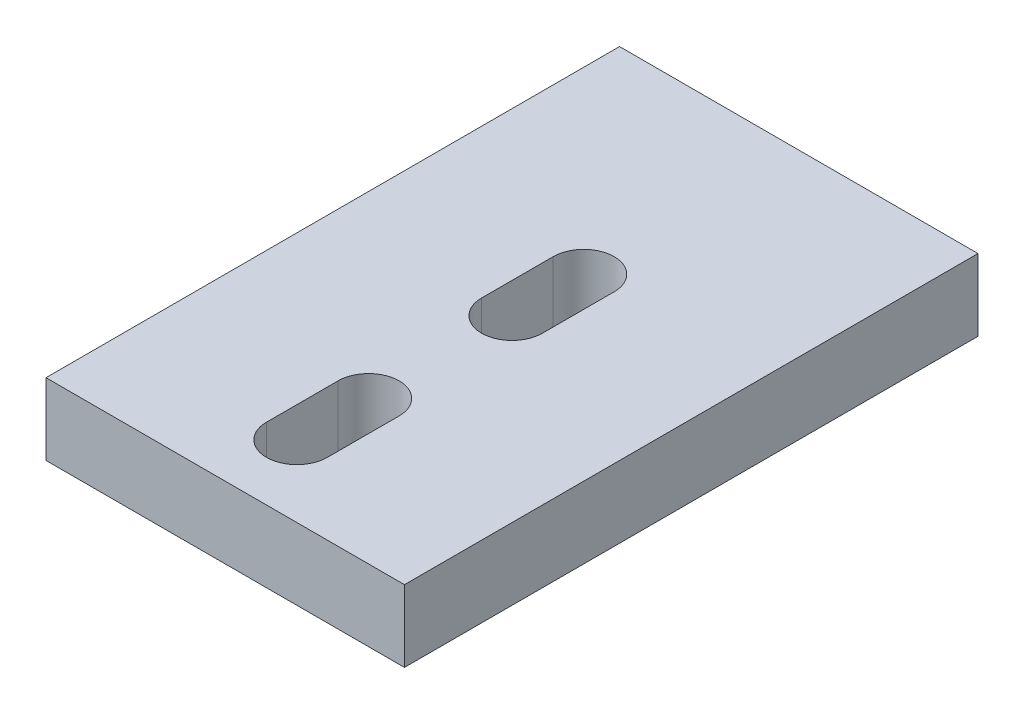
ISO-10303-21;
HEADER;
FILE_DESCRIPTION(('STEP AP214'),'2;1');
FILE_NAME('part.step','',(''),(''),'','','');
FILE_SCHEMA(('AUTOMOTIVE_DESIGN { 1 0 10303 214 1 1 1 1 }'));
ENDSEC;
DATA;
#1=APPLICATION_CONTEXT('core data for automotive mechanical design processes');
#2=APPLICATION_PROTOCOL_DEFINITION('international standard','automotive_design',2000,#1);
#3=PRODUCT_CONTEXT('',#1,'mechanical');
#4=PRODUCT('Part','Part','',(#3));
#5=PRODUCT_RELATED_PRODUCT_CATEGORY('part','',(#4));
#6=PRODUCT_DEFINITION_FORMATION('','',#4);
#7=PRODUCT_DEFINITION_CONTEXT('part definition',#1,'design');
#8=PRODUCT_DEFINITION('design','',#6,#7);
#9=PRODUCT_DEFINITION_SHAPE('','',#8);
#10=(LENGTH_UNIT() NAMED_UNIT(*) SI_UNIT(.MILLI.,.METRE.));
#11=(NAMED_UNIT(*) PLANE_ANGLE_UNIT() SI_UNIT($,.RADIAN.));
#12=(NAMED_UNIT(*) SI_UNIT($,.STERADIAN.) SOLID_ANGLE_UNIT());
#13=UNCERTAINTY_MEASURE_WITH_UNIT(LENGTH_MEASURE(1.E-05),#10,'distance_accuracy_value','');
#14=(GEOMETRIC_REPRESENTATION_CONTEXT(3) GLOBAL_UNCERTAINTY_ASSIGNED_CONTEXT((#13)) GLOBAL_UNIT_ASSIGNED_CONTEXT((#10,
#11,#12)) REPRESENTATION_CONTEXT('',''));
#15=CARTESIAN_POINT('',(0.,0.,0.));
#16=DIRECTION('',(0.,0.,1.));
#17=DIRECTION('',(1.,0.,0.));
#18=AXIS2_PLACEMENT_3D('',#15,#16,#17);
#19=CARTESIAN_POINT('',(-50.,-10.,40.));
#20=DIRECTION('',(1.,0.,0.));
#21=DIRECTION('',(0.,0.,-1.));
#22=AXIS2_PLACEMENT_3D('',#19,#20,#21);
#23=PLANE('',#22);
#24=DIRECTION('',(0.,-1.,0.));
#25=VECTOR('',#24,1.);
#26=CARTESIAN_POINT('',(-50.,-10.,-40.));
#27=LINE('',#26,#25);
#28=CARTESIAN_POINT('',(-50.,0.,-40.));
#29=VERTEX_POINT('',#28);
#30=CARTESIAN_POINT('',(-50.,-10.,-40.));
#31=VERTEX_POINT('',#30);
#32=EDGE_CURVE('E219',#29,#31,#27,.T.);
#33=ORIENTED_EDGE('',*,*,#32,.T.);
#34=DIRECTION('',(0.,0.,-1.));
#35=VECTOR('',#34,1.);
#36=CARTESIAN_POINT('',(-50.,-10.,40.));
#37=LINE('',#36,#35);
#38=CARTESIAN_POINT('',(-50.,-10.,40.));
#39=VERTEX_POINT('',#38);
#40=EDGE_CURVE('E11',#39,#31,#37,.T.);
#41=ORIENTED_EDGE('',*,*,#40,.F.);
#42=DIRECTION('',(0.,-1.,0.));
#43=VECTOR('',#42,1.);
#44=CARTESIAN_POINT('',(-50.,-10.,40.));
#45=LINE('',#44,#43);
#46=CARTESIAN_POINT('',(-50.,0.,40.));
#47=VERTEX_POINT('',#46);
#48=EDGE_CURVE('E232',#47,#39,#45,.T.);
#49=ORIENTED_EDGE('',*,*,#48,.F.);
#50=DIRECTION('',(0.,0.,-1.));
#51=VECTOR('',#50,1.);
#52=CARTESIAN_POINT('',(-50.,0.,40.));
#53=LINE('',#52,#51);
#54=EDGE_CURVE('E245',#47,#29,#53,.T.);
#55=ORIENTED_EDGE('',*,*,#54,.T.);
#56=EDGE_LOOP('',(#33,#41,#49,#55));
#57=FACE_BOUND('',#56,.T.);
#58=ADVANCED_FACE('F40',(#57),#23,.F.);
#59=CARTESIAN_POINT('',(0.,-10.,40.));
#60=DIRECTION('',(0.,1.,0.));
#61=DIRECTION('',(-1.,0.,0.));
#62=AXIS2_PLACEMENT_3D('',#59,#60,#61);
#63=PLANE('',#62);
#64=DIRECTION('',(0.,0.,-1.));
#65=VECTOR('',#64,1.);
#66=CARTESIAN_POINT('',(-29.25,-10.,0.));
#67=LINE('',#66,#65);
#68=CARTESIAN_POINT('',(-29.25,-10.,0.));
#69=VERTEX_POINT('',#68);
#70=CARTESIAN_POINT('',(-29.25,-10.,-10.));
#71=VERTEX_POINT('',#70);
#72=EDGE_CURVE('E151',#69,#71,#67,.T.);
#73=ORIENTED_EDGE('',*,*,#72,.F.);
#74=CARTESIAN_POINT('',(-25.,-10.,0.));
#75=DIRECTION('',(0.,1.,0.));
#76=DIRECTION('',(-1.,0.,0.));
#77=AXIS2_PLACEMENT_3D('',#74,#75,#76);
#78=CIRCLE('',#77,4.25);
#79=CARTESIAN_POINT('',(-20.75,-10.,0.));
#80=VERTEX_POINT('',#79);
#81=EDGE_CURVE('E131',#80,#69,#78,.F.);
#82=ORIENTED_EDGE('',*,*,#81,.F.);
#83=DIRECTION('',(0.,0.,1.));
#84=VECTOR('',#83,1.);
#85=CARTESIAN_POINT('',(-20.75,-10.,0.));
#86=LINE('',#85,#84);
#87=CARTESIAN_POINT('',(-20.75,-10.,-10.));
#88=VERTEX_POINT('',#87);
#89=EDGE_CURVE('E141',#88,#80,#86,.T.);
#90=ORIENTED_EDGE('',*,*,#89,.F.);
#91=CARTESIAN_POINT('',(-25.,-10.,-10.));
#92=DIRECTION('',(0.,1.,0.));
#93=DIRECTION('',(-1.,0.,0.));
#94=AXIS2_PLACEMENT_3D('',#91,#92,#93);
#95=CIRCLE('',#94,4.25);
#96=EDGE_CURVE('E55',#71,#88,#95,.F.);
#97=ORIENTED_EDGE('',*,*,#96,.F.);
#98=EDGE_LOOP('',(#73,#82,#90,#97));
#99=FACE_BOUND('',#98,.T.);
#100=DIRECTION('',(0.,0.,-1.));
#101=VECTOR('',#100,1.);
#102=CARTESIAN_POINT('',(-29.25,-10.,30.));
#103=LINE('',#102,#101);
#104=CARTESIAN_POINT('',(-29.25,-10.,30.));
#105=VERTEX_POINT('',#104);
#106=CARTESIAN_POINT('',(-29.25,-10.,20.));
#107=VERTEX_POINT('',#106);
#108=EDGE_CURVE('E181',#105,#107,#103,.T.);
#109=ORIENTED_EDGE('',*,*,#108,.F.);
#110=CARTESIAN_POINT('',(-25.,-10.,30.));
#111=DIRECTION('',(0.,1.,0.));
#112=DIRECTION('',(-1.,0.,0.));
#113=AXIS2_PLACEMENT_3D('',#110,#111,#112);
#114=CIRCLE('',#113,4.25);
#115=CARTESIAN_POINT('',(-20.75,-10.,30.));
#116=VERTEX_POINT('',#115);
#117=EDGE_CURVE('E185',#116,#105,#114,.F.);
#118=ORIENTED_EDGE('',*,*,#117,.F.);
#119=DIRECTION('',(0.,0.,1.));
#120=VECTOR('',#119,1.);
#121=CARTESIAN_POINT('',(-20.75,-10.,30.));
#122=LINE('',#121,#120);
#123=CARTESIAN_POINT('',(-20.75,-10.,20.));
#124=VERTEX_POINT('',#123);
#125=EDGE_CURVE('E207',#124,#116,#122,.T.);
#126=ORIENTED_EDGE('',*,*,#125,.F.);
#127=CARTESIAN_POINT('',(-25.,-10.,20.));
#128=DIRECTION('',(0.,1.,0.));
#129=DIRECTION('',(-1.,0.,0.));
#130=AXIS2_PLACEMENT_3D('',#127,#128,#129);
#131=CIRCLE('',#130,4.25);
#132=EDGE_CURVE('E145',#107,#124,#131,.F.);
#133=ORIENTED_EDGE('',*,*,#132,.F.);
#134=EDGE_LOOP('',(#109,#118,#126,#133));
#135=FACE_BOUND('',#134,.T.);
#136=DIRECTION('',(1.,0.,0.));
#137=VECTOR('',#136,1.);
#138=CARTESIAN_POINT('',(0.,-10.,-40.));
#139=LINE('',#138,#137);
#140=CARTESIAN_POINT('',(0.,-10.,-40.));
#141=VERTEX_POINT('',#140);
#142=EDGE_CURVE('E223',#31,#141,#139,.T.);
#143=ORIENTED_EDGE('',*,*,#142,.T.);
#144=DIRECTION('',(0.,0.,-1.));
#145=VECTOR('',#144,1.);
#146=CARTESIAN_POINT('',(0.,-10.,40.));
#147=LINE('',#146,#145);
#148=CARTESIAN_POINT('',(0.,-10.,40.));
#149=VERTEX_POINT('',#148);
#150=EDGE_CURVE('E48',#149,#141,#147,.T.);
#151=ORIENTED_EDGE('',*,*,#150,.F.);
#152=DIRECTION('',(1.,0.,0.));
#153=VECTOR('',#152,1.);
#154=CARTESIAN_POINT('',(0.,-10.,40.));
#155=LINE('',#154,#153);
#156=EDGE_CURVE('E236',#39,#149,#155,.T.);
#157=ORIENTED_EDGE('',*,*,#156,.F.);
#158=ORIENTED_EDGE('',*,*,#40,.T.);
#159=EDGE_LOOP('',(#143,#151,#157,#158));
#160=FACE_BOUND('',#159,.T.);
#161=ADVANCED_FACE('F148',(#99,#135,#160),#63,.F.);
#162=CARTESIAN_POINT('',(0.,0.,40.));
#163=DIRECTION('',(-1.,0.,0.));
#164=DIRECTION('',(0.,-1.,0.));
#165=AXIS2_PLACEMENT_3D('',#162,#163,#164);
#166=PLANE('',#165);
#167=DIRECTION('',(0.,1.,0.));
#168=VECTOR('',#167,1.);
#169=CARTESIAN_POINT('',(0.,0.,-40.));
#170=LINE('',#169,#168);
#171=CARTESIAN_POINT('',(0.,0.,-40.));
#172=VERTEX_POINT('',#171);
#173=EDGE_CURVE('E226',#141,#172,#170,.T.);
#174=ORIENTED_EDGE('',*,*,#173,.T.);
#175=DIRECTION('',(0.,0.,-1.));
#176=VECTOR('',#175,1.);
#177=CARTESIAN_POINT('',(0.,0.,40.));
#178=LINE('',#177,#176);
#179=CARTESIAN_POINT('',(0.,0.,40.));
#180=VERTEX_POINT('',#179);
#181=EDGE_CURVE('E249',#180,#172,#178,.T.);
#182=ORIENTED_EDGE('',*,*,#181,.F.);
#183=DIRECTION('',(0.,1.,0.));
#184=VECTOR('',#183,1.);
#185=CARTESIAN_POINT('',(0.,0.,40.));
#186=LINE('',#185,#184);
#187=EDGE_CURVE('E239',#149,#180,#186,.T.);
#188=ORIENTED_EDGE('',*,*,#187,.F.);
#189=ORIENTED_EDGE('',*,*,#150,.T.);
#190=EDGE_LOOP('',(#174,#182,#188,#189));
#191=FACE_BOUND('',#190,.T.);
#192=ADVANCED_FACE('F258',(#191),#166,.F.);
#193=CARTESIAN_POINT('',(-50.,0.,40.));
#194=DIRECTION('',(0.,-1.,0.));
#195=DIRECTION('',(0.,0.,-1.));
#196=AXIS2_PLACEMENT_3D('',#193,#194,#195);
#197=PLANE('',#196);
#198=DIRECTION('',(0.,0.,-1.));
#199=VECTOR('',#198,1.);
#200=CARTESIAN_POINT('',(-20.75,0.,0.));
#201=LINE('',#200,#199);
#202=CARTESIAN_POINT('',(-20.75,0.,0.));
#203=VERTEX_POINT('',#202);
#204=CARTESIAN_POINT('',(-20.75,0.,-10.));
#205=VERTEX_POINT('',#204);
#206=EDGE_CURVE('E157',#203,#205,#201,.T.);
#207=ORIENTED_EDGE('',*,*,#206,.F.);
#208=CARTESIAN_POINT('',(-25.,0.,0.));
#209=DIRECTION('',(0.,1.,0.));
#210=DIRECTION('',(0.,0.,-1.));
#211=AXIS2_PLACEMENT_3D('',#208,#209,#210);
#212=CIRCLE('',#211,4.25);
#213=CARTESIAN_POINT('',(-29.25,0.,0.));
#214=VERTEX_POINT('',#213);
#215=EDGE_CURVE('E63',#214,#203,#212,.T.);
#216=ORIENTED_EDGE('',*,*,#215,.F.);
#217=DIRECTION('',(0.,0.,1.));
#218=VECTOR('',#217,1.);
#219=CARTESIAN_POINT('',(-29.25,0.,0.));
#220=LINE('',#219,#218);
#221=CARTESIAN_POINT('',(-29.25,0.,-10.));
#222=VERTEX_POINT('',#221);
#223=EDGE_CURVE('E138',#222,#214,#220,.T.);
#224=ORIENTED_EDGE('',*,*,#223,.F.);
#225=CARTESIAN_POINT('',(-25.,0.,-10.));
#226=DIRECTION('',(0.,1.,0.));
#227=DIRECTION('',(0.,0.,1.));
#228=AXIS2_PLACEMENT_3D('',#225,#226,#227);
#229=CIRCLE('',#228,4.25);
#230=EDGE_CURVE('E165',#205,#222,#229,.T.);
#231=ORIENTED_EDGE('',*,*,#230,.F.);
#232=EDGE_LOOP('',(#207,#216,#224,#231));
#233=FACE_BOUND('',#232,.T.);
#234=DIRECTION('',(0.,0.,-1.));
#235=VECTOR('',#234,1.);
#236=CARTESIAN_POINT('',(-20.75,0.,30.));
#237=LINE('',#236,#235);
#238=CARTESIAN_POINT('',(-20.75,0.,30.));
#239=VERTEX_POINT('',#238);
#240=CARTESIAN_POINT('',(-20.75,0.,20.));
#241=VERTEX_POINT('',#240);
#242=EDGE_CURVE('E192',#239,#241,#237,.T.);
#243=ORIENTED_EDGE('',*,*,#242,.F.);
#244=CARTESIAN_POINT('',(-25.,0.,30.));
#245=DIRECTION('',(0.,1.,0.));
#246=DIRECTION('',(0.,0.,-1.));
#247=AXIS2_PLACEMENT_3D('',#244,#245,#246);
#248=CIRCLE('',#247,4.25);
#249=CARTESIAN_POINT('',(-29.25,0.,30.));
#250=VERTEX_POINT('',#249);
#251=EDGE_CURVE('E189',#250,#239,#248,.T.);
#252=ORIENTED_EDGE('',*,*,#251,.F.);
#253=DIRECTION('',(0.,0.,1.));
#254=VECTOR('',#253,1.);
#255=CARTESIAN_POINT('',(-29.25,0.,30.));
#256=LINE('',#255,#254);
#257=CARTESIAN_POINT('',(-29.25,0.,20.));
#258=VERTEX_POINT('',#257);
#259=EDGE_CURVE('E200',#258,#250,#256,.T.);
#260=ORIENTED_EDGE('',*,*,#259,.F.);
#261=CARTESIAN_POINT('',(-25.,0.,20.));
#262=DIRECTION('',(0.,1.,0.));
#263=DIRECTION('',(0.,0.,1.));
#264=AXIS2_PLACEMENT_3D('',#261,#262,#263);
#265=CIRCLE('',#264,4.25);
#266=EDGE_CURVE('E196',#241,#258,#265,.T.);
#267=ORIENTED_EDGE('',*,*,#266,.F.);
#268=EDGE_LOOP('',(#243,#252,#260,#267));
#269=FACE_BOUND('',#268,.T.);
#270=DIRECTION('',(-1.,0.,0.));
#271=VECTOR('',#270,1.);
#272=CARTESIAN_POINT('',(-50.,0.,-40.));
#273=LINE('',#272,#271);
#274=EDGE_CURVE('E229',#172,#29,#273,.T.);
#275=ORIENTED_EDGE('',*,*,#274,.T.);
#276=ORIENTED_EDGE('',*,*,#54,.F.);
#277=DIRECTION('',(-1.,0.,0.));
#278=VECTOR('',#277,1.);
#279=CARTESIAN_POINT('',(-50.,0.,40.));
#280=LINE('',#279,#278);
#281=EDGE_CURVE('E242',#180,#47,#280,.T.);
#282=ORIENTED_EDGE('',*,*,#281,.F.);
#283=ORIENTED_EDGE('',*,*,#181,.T.);
#284=EDGE_LOOP('',(#275,#276,#282,#283));
#285=FACE_BOUND('',#284,.T.);
#286=ADVANCED_FACE('F267',(#233,#269,#285),#197,.F.);
#287=CARTESIAN_POINT('',(-50.,0.,40.));
#288=DIRECTION('',(0.,0.,-1.));
#289=DIRECTION('',(-1.,0.,0.));
#290=AXIS2_PLACEMENT_3D('',#287,#288,#289);
#291=PLANE('',#290);
#292=ORIENTED_EDGE('',*,*,#48,.T.);
#293=ORIENTED_EDGE('',*,*,#156,.T.);
#294=ORIENTED_EDGE('',*,*,#187,.T.);
#295=ORIENTED_EDGE('',*,*,#281,.T.);
#296=EDGE_LOOP('',(#292,#293,#294,#295));
#297=FACE_BOUND('',#296,.T.);
#298=ADVANCED_FACE('F273',(#297),#291,.F.);
#299=CARTESIAN_POINT('',(-50.,0.,-40.));
#300=DIRECTION('',(0.,0.,-1.));
#301=DIRECTION('',(-1.,0.,0.));
#302=AXIS2_PLACEMENT_3D('',#299,#300,#301);
#303=PLANE('',#302);
#304=ORIENTED_EDGE('',*,*,#32,.F.);
#305=ORIENTED_EDGE('',*,*,#274,.F.);
#306=ORIENTED_EDGE('',*,*,#173,.F.);
#307=ORIENTED_EDGE('',*,*,#142,.F.);
#308=EDGE_LOOP('',(#304,#305,#306,#307));
#309=FACE_BOUND('',#308,.T.);
#310=ADVANCED_FACE('F264',(#309),#303,.T.);
#311=CARTESIAN_POINT('',(-25.,-10.001,30.));
#312=DIRECTION('',(0.,1.,0.));
#313=DIRECTION('',(0.,0.,1.));
#314=AXIS2_PLACEMENT_3D('',#311,#312,#313);
#315=CYLINDRICAL_SURFACE('',#314,4.25);
#316=ORIENTED_EDGE('',*,*,#117,.T.);
#317=DIRECTION('',(0.,1.,0.));
#318=VECTOR('',#317,1.);
#319=CARTESIAN_POINT('',(-29.25,-10.001,30.));
#320=LINE('',#319,#318);
#321=EDGE_CURVE('E204',#105,#250,#320,.T.);
#322=ORIENTED_EDGE('',*,*,#321,.T.);
#323=ORIENTED_EDGE('',*,*,#251,.T.);
#324=DIRECTION('',(0.,1.,0.));
#325=VECTOR('',#324,1.);
#326=CARTESIAN_POINT('',(-20.75,-10.001,30.));
#327=LINE('',#326,#325);
#328=EDGE_CURVE('E203',#116,#239,#327,.T.);
#329=ORIENTED_EDGE('',*,*,#328,.F.);
#330=EDGE_LOOP('',(#316,#322,#323,#329));
#331=FACE_BOUND('',#330,.T.);
#332=ADVANCED_FACE('F288',(#331),#315,.F.);
#333=CARTESIAN_POINT('',(-29.25,-10.001,30.));
#334=DIRECTION('',(-1.,0.,0.));
#335=DIRECTION('',(0.,0.,1.));
#336=AXIS2_PLACEMENT_3D('',#333,#334,#335);
#337=PLANE('',#336);
#338=ORIENTED_EDGE('',*,*,#108,.T.);
#339=DIRECTION('',(0.,1.,0.));
#340=VECTOR('',#339,1.);
#341=CARTESIAN_POINT('',(-29.25,-10.001,20.));
#342=LINE('',#341,#340);
#343=EDGE_CURVE('E208',#107,#258,#342,.T.);
#344=ORIENTED_EDGE('',*,*,#343,.T.);
#345=ORIENTED_EDGE('',*,*,#259,.T.);
#346=ORIENTED_EDGE('',*,*,#321,.F.);
#347=EDGE_LOOP('',(#338,#344,#345,#346));
#348=FACE_BOUND('',#347,.T.);
#349=ADVANCED_FACE('F291',(#348),#337,.F.);
#350=CARTESIAN_POINT('',(-25.,-10.001,20.));
#351=DIRECTION('',(0.,1.,0.));
#352=DIRECTION('',(0.,0.,1.));
#353=AXIS2_PLACEMENT_3D('',#350,#351,#352);
#354=CYLINDRICAL_SURFACE('',#353,4.25);
#355=ORIENTED_EDGE('',*,*,#132,.T.);
#356=DIRECTION('',(0.,1.,0.));
#357=VECTOR('',#356,1.);
#358=CARTESIAN_POINT('',(-20.75,-10.001,20.));
#359=LINE('',#358,#357);
#360=EDGE_CURVE('E211',#124,#241,#359,.T.);
#361=ORIENTED_EDGE('',*,*,#360,.T.);
#362=ORIENTED_EDGE('',*,*,#266,.T.);
#363=ORIENTED_EDGE('',*,*,#343,.F.);
#364=EDGE_LOOP('',(#355,#361,#362,#363));
#365=FACE_BOUND('',#364,.T.);
#366=ADVANCED_FACE('F296',(#365),#354,.F.);
#367=CARTESIAN_POINT('',(-20.75,-10.001,30.));
#368=DIRECTION('',(1.,0.,0.));
#369=DIRECTION('',(0.,0.,-1.));
#370=AXIS2_PLACEMENT_3D('',#367,#368,#369);
#371=PLANE('',#370);
#372=ORIENTED_EDGE('',*,*,#125,.T.);
#373=ORIENTED_EDGE('',*,*,#328,.T.);
#374=ORIENTED_EDGE('',*,*,#242,.T.);
#375=ORIENTED_EDGE('',*,*,#360,.F.);
#376=EDGE_LOOP('',(#372,#373,#374,#375));
#377=FACE_BOUND('',#376,.T.);
#378=ADVANCED_FACE('F293',(#377),#371,.F.);
#379=CARTESIAN_POINT('',(-25.,-10.001,0.));
#380=DIRECTION('',(0.,1.,0.));
#381=DIRECTION('',(0.,0.,1.));
#382=AXIS2_PLACEMENT_3D('',#379,#380,#381);
#383=CYLINDRICAL_SURFACE('',#382,4.25);
#384=ORIENTED_EDGE('',*,*,#81,.T.);
#385=DIRECTION('',(0.,1.,0.));
#386=VECTOR('',#385,1.);
#387=CARTESIAN_POINT('',(-29.25,-10.001,0.));
#388=LINE('',#387,#386);
#389=EDGE_CURVE('E146',#69,#214,#388,.T.);
#390=ORIENTED_EDGE('',*,*,#389,.T.);
#391=ORIENTED_EDGE('',*,*,#215,.T.);
#392=DIRECTION('',(0.,1.,0.));
#393=VECTOR('',#392,1.);
#394=CARTESIAN_POINT('',(-20.75,-10.001,0.));
#395=LINE('',#394,#393);
#396=EDGE_CURVE('E127',#80,#203,#395,.T.);
#397=ORIENTED_EDGE('',*,*,#396,.F.);
#398=EDGE_LOOP('',(#384,#390,#391,#397));
#399=FACE_BOUND('',#398,.T.);
#400=ADVANCED_FACE('F129',(#399),#383,.F.);
#401=CARTESIAN_POINT('',(-29.25,-10.001,0.));
#402=DIRECTION('',(-1.,0.,0.));
#403=DIRECTION('',(0.,0.,1.));
#404=AXIS2_PLACEMENT_3D('',#401,#402,#403);
#405=PLANE('',#404);
#406=ORIENTED_EDGE('',*,*,#72,.T.);
#407=DIRECTION('',(0.,1.,0.));
#408=VECTOR('',#407,1.);
#409=CARTESIAN_POINT('',(-29.25,-10.001,-10.));
#410=LINE('',#409,#408);
#411=EDGE_CURVE('E174',#71,#222,#410,.T.);
#412=ORIENTED_EDGE('',*,*,#411,.T.);
#413=ORIENTED_EDGE('',*,*,#223,.T.);
#414=ORIENTED_EDGE('',*,*,#389,.F.);
#415=EDGE_LOOP('',(#406,#412,#413,#414));
#416=FACE_BOUND('',#415,.T.);
#417=ADVANCED_FACE('F306',(#416),#405,.F.);
#418=CARTESIAN_POINT('',(-25.,-10.001,-10.));
#419=DIRECTION('',(0.,1.,0.));
#420=DIRECTION('',(0.,0.,1.));
#421=AXIS2_PLACEMENT_3D('',#418,#419,#420);
#422=CYLINDRICAL_SURFACE('',#421,4.25);
#423=ORIENTED_EDGE('',*,*,#96,.T.);
#424=DIRECTION('',(0.,1.,0.));
#425=VECTOR('',#424,1.);
#426=CARTESIAN_POINT('',(-20.75,-10.001,-10.));
#427=LINE('',#426,#425);
#428=EDGE_CURVE('E137',#88,#205,#427,.T.);
#429=ORIENTED_EDGE('',*,*,#428,.T.);
#430=ORIENTED_EDGE('',*,*,#230,.T.);
#431=ORIENTED_EDGE('',*,*,#411,.F.);
#432=EDGE_LOOP('',(#423,#429,#430,#431));
#433=FACE_BOUND('',#432,.T.);
#434=ADVANCED_FACE('F309',(#433),#422,.F.);
#435=CARTESIAN_POINT('',(-20.75,-10.001,0.));
#436=DIRECTION('',(1.,0.,0.));
#437=DIRECTION('',(0.,0.,-1.));
#438=AXIS2_PLACEMENT_3D('',#435,#436,#437);
#439=PLANE('',#438);
#440=ORIENTED_EDGE('',*,*,#89,.T.);
#441=ORIENTED_EDGE('',*,*,#396,.T.);
#442=ORIENTED_EDGE('',*,*,#206,.T.);
#443=ORIENTED_EDGE('',*,*,#428,.F.);
#444=EDGE_LOOP('',(#440,#441,#442,#443));
#445=FACE_BOUND('',#444,.T.);
#446=ADVANCED_FACE('F142',(#445),#439,.F.);
#447=CLOSED_SHELL('',(#58,#161,#192,#286,#298,#310,#332,#349,#366,#378,#400,#417,#434,#446));
#448=MANIFOLD_SOLID_BREP('B2',#447);
#449=ADVANCED_BREP_SHAPE_REPRESENTATION('',(#18,#448),#14);
#450=SHAPE_DEFINITION_REPRESENTATION(#9,#449);
ENDSEC;
END-ISO-10303-21;
